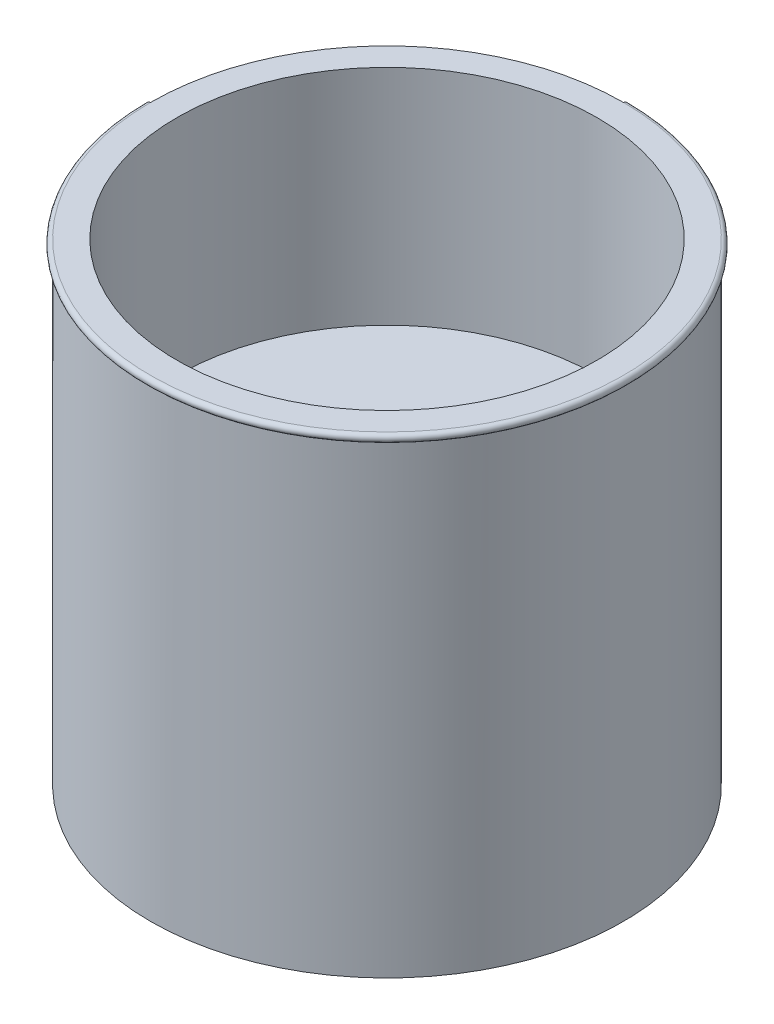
from build123d import *

# Parameters (mm, degrees)
SKETCH2_R = 3.96875


with BuildPart() as part:
    # Sketch1 → Revolve2 (revolve)
    with BuildSketch(Plane.XY, mode=Mode.PRIVATE) as revolve2_sk:
        Polygon((-228.6, 228.6), (-228.6, -228.6), (-203.2, -228.6), (-203.2, -12.7), (0, -12.7), (0, 12.7), (-203.2, 12.7), (-203.2, 228.6), align=None)
    revolve(revolve2_sk.sketch.rotate(Axis((0, 0, 0), (0, 1, 0)), 270), axis=Axis((0, 0, 0), (0, 1, 0)))

    # Sweep1: sweep along a path in Sketch3
    with BuildLine(Plane(origin=(0, 224.63125, 0), x_dir=(-1, 0, 0), z_dir=(0, 1, 0))) as sweep1_path:
        ThreePointArc((232.56875, 0), (-164.450940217, 164.450940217), (0, -232.56875))
    # Sketch2 → Sweep1 (sweep)
    with BuildSketch(Plane.XY):
        with Locations((-228.6, 224.63125)):
            Circle(SKETCH2_R)
    sweep(path=sweep1_path.line)


solid = part.part
